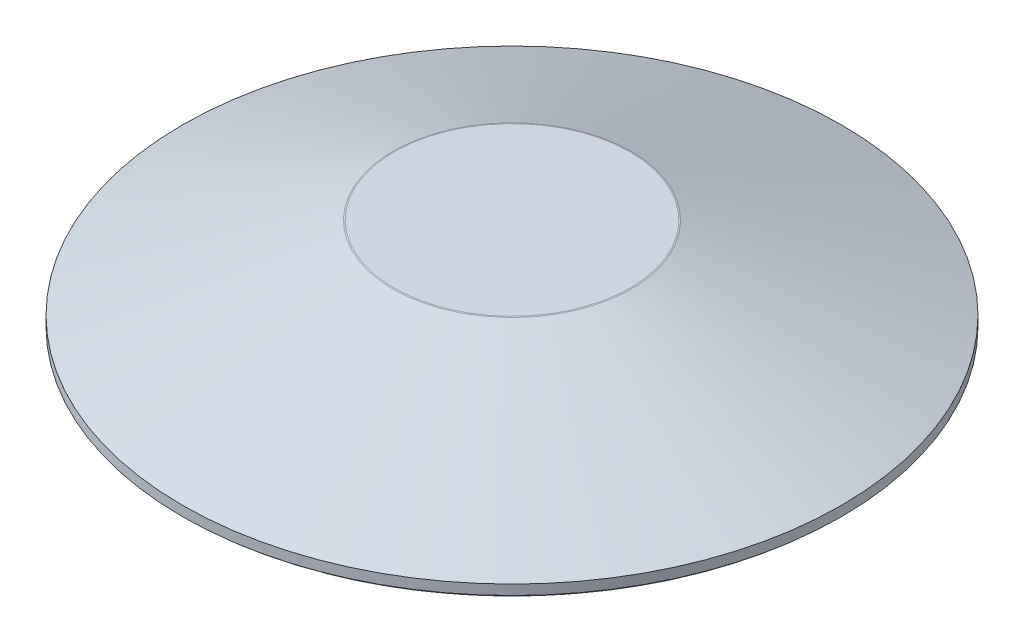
ISO-10303-21;
HEADER;
FILE_DESCRIPTION(('STEP AP214'),'2;1');
FILE_NAME('part.step','',(''),(''),'','','');
FILE_SCHEMA(('AUTOMOTIVE_DESIGN { 1 0 10303 214 1 1 1 1 }'));
ENDSEC;
DATA;
#1=APPLICATION_CONTEXT('core data for automotive mechanical design processes');
#2=APPLICATION_PROTOCOL_DEFINITION('international standard','automotive_design',2000,#1);
#3=PRODUCT_CONTEXT('',#1,'mechanical');
#4=PRODUCT('Part','Part','',(#3));
#5=PRODUCT_RELATED_PRODUCT_CATEGORY('part','',(#4));
#6=PRODUCT_DEFINITION_FORMATION('','',#4);
#7=PRODUCT_DEFINITION_CONTEXT('part definition',#1,'design');
#8=PRODUCT_DEFINITION('design','',#6,#7);
#9=PRODUCT_DEFINITION_SHAPE('','',#8);
#10=(LENGTH_UNIT() NAMED_UNIT(*) SI_UNIT(.MILLI.,.METRE.));
#11=(NAMED_UNIT(*) PLANE_ANGLE_UNIT() SI_UNIT($,.RADIAN.));
#12=(NAMED_UNIT(*) SI_UNIT($,.STERADIAN.) SOLID_ANGLE_UNIT());
#13=UNCERTAINTY_MEASURE_WITH_UNIT(LENGTH_MEASURE(1.E-05),#10,'distance_accuracy_value','');
#14=(GEOMETRIC_REPRESENTATION_CONTEXT(3) GLOBAL_UNCERTAINTY_ASSIGNED_CONTEXT((#13)) GLOBAL_UNIT_ASSIGNED_CONTEXT((#10,
#11,#12)) REPRESENTATION_CONTEXT('',''));
#15=CARTESIAN_POINT('',(0.,0.,0.));
#16=DIRECTION('',(0.,0.,1.));
#17=DIRECTION('',(1.,0.,0.));
#18=AXIS2_PLACEMENT_3D('',#15,#16,#17);
#19=CARTESIAN_POINT('',(0.,0.762500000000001,0.));
#20=DIRECTION('',(0.,-1.,0.));
#21=DIRECTION('',(0.,0.,-1.));
#22=AXIS2_PLACEMENT_3D('',#19,#20,#21);
#23=TOROIDAL_SURFACE('',#22,0.76215277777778,0.53784722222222);
#24=CARTESIAN_POINT('',(0.,1.18566154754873,0.));
#25=DIRECTION('',(0.,-1.,0.));
#26=DIRECTION('',(0.,0.,-1.));
#27=AXIS2_PLACEMENT_3D('',#24,#25,#26);
#28=CIRCLE('',#27,1.09413762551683);
#29=CARTESIAN_POINT('',(0.,1.18566154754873,-1.09413762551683));
#30=VERTEX_POINT('',#29);
#31=EDGE_CURVE('E10',#30,#30,#28,.T.);
#32=ORIENTED_EDGE('',*,*,#31,.T.);
#33=EDGE_LOOP('',(#32));
#34=FACE_BOUND('',#33,.T.);
#35=CARTESIAN_POINT('',(0.,0.327254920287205,0.));
#36=DIRECTION('',(0.,1.,0.));
#37=DIRECTION('',(0.,0.,1.));
#38=AXIS2_PLACEMENT_3D('',#35,#36,#37);
#39=CIRCLE('',#38,1.0781296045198);
#40=CARTESIAN_POINT('',(0.,0.327254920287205,1.0781296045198));
#41=VERTEX_POINT('',#40);
#42=EDGE_CURVE('E44',#41,#41,#39,.T.);
#43=ORIENTED_EDGE('',*,*,#42,.T.);
#44=EDGE_LOOP('',(#43));
#45=FACE_BOUND('',#44,.T.);
#46=ADVANCED_FACE('F37',(#34,#45),#23,.T.);
#47=CARTESIAN_POINT('',(0.,0.,0.));
#48=DIRECTION('',(0.,-1.,0.));
#49=DIRECTION('',(0.,0.,-1.));
#50=AXIS2_PLACEMENT_3D('',#47,#48,#49);
#51=CYLINDRICAL_SURFACE('',#50,1.075);
#52=CARTESIAN_POINT('',(0.,2.35,0.));
#53=DIRECTION('',(0.,1.,0.));
#54=DIRECTION('',(0.,0.,1.));
#55=AXIS2_PLACEMENT_3D('',#52,#53,#54);
#56=CIRCLE('',#55,1.075);
#57=CARTESIAN_POINT('',(0.,2.35,1.075));
#58=VERTEX_POINT('',#57);
#59=EDGE_CURVE('E60',#58,#58,#56,.F.);
#60=ORIENTED_EDGE('',*,*,#59,.T.);
#61=EDGE_LOOP('',(#60));
#62=FACE_BOUND('',#61,.T.);
#63=CARTESIAN_POINT('',(0.,1.225,0.));
#64=DIRECTION('',(0.,-1.,0.));
#65=DIRECTION('',(0.,0.,-1.));
#66=AXIS2_PLACEMENT_3D('',#63,#64,#65);
#67=CIRCLE('',#66,1.075);
#68=CARTESIAN_POINT('',(0.,1.225,-1.075));
#69=VERTEX_POINT('',#68);
#70=EDGE_CURVE('E63',#69,#69,#67,.F.);
#71=ORIENTED_EDGE('',*,*,#70,.T.);
#72=EDGE_LOOP('',(#71));
#73=FACE_BOUND('',#72,.T.);
#74=ADVANCED_FACE('F118',(#62,#73),#51,.T.);
#75=CARTESIAN_POINT('',(0.,2.4,0.));
#76=DIRECTION('',(0.,1.,0.));
#77=DIRECTION('',(0.,0.,1.));
#78=AXIS2_PLACEMENT_3D('',#75,#76,#77);
#79=PLANE('',#78);
#80=CARTESIAN_POINT('',(0.,2.4,0.));
#81=DIRECTION('',(0.,1.,0.));
#82=DIRECTION('',(0.,0.,1.));
#83=AXIS2_PLACEMENT_3D('',#80,#81,#82);
#84=CIRCLE('',#83,1.85);
#85=CARTESIAN_POINT('',(0.,2.4,1.85));
#86=VERTEX_POINT('',#85);
#87=EDGE_CURVE('E66',#86,#86,#84,.F.);
#88=ORIENTED_EDGE('',*,*,#87,.T.);
#89=EDGE_LOOP('',(#88));
#90=FACE_BOUND('',#89,.T.);
#91=CARTESIAN_POINT('',(0.,2.4,0.));
#92=DIRECTION('',(0.,1.,0.));
#93=DIRECTION('',(0.,0.,1.));
#94=AXIS2_PLACEMENT_3D('',#91,#92,#93);
#95=CIRCLE('',#94,1.125);
#96=CARTESIAN_POINT('',(0.,2.4,1.125));
#97=VERTEX_POINT('',#96);
#98=EDGE_CURVE('E69',#97,#97,#95,.T.);
#99=ORIENTED_EDGE('',*,*,#98,.T.);
#100=EDGE_LOOP('',(#99));
#101=FACE_BOUND('',#100,.T.);
#102=ADVANCED_FACE('F123',(#90,#101),#79,.F.);
#103=CARTESIAN_POINT('',(0.,0.,0.));
#104=DIRECTION('',(0.,-1.,0.));
#105=DIRECTION('',(0.,0.,-1.));
#106=AXIS2_PLACEMENT_3D('',#103,#104,#105);
#107=CYLINDRICAL_SURFACE('',#106,1.9);
#108=CARTESIAN_POINT('',(0.,2.98596117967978,0.));
#109=DIRECTION('',(0.,-1.,0.));
#110=DIRECTION('',(0.,0.,-1.));
#111=AXIS2_PLACEMENT_3D('',#108,#109,#110);
#112=CIRCLE('',#111,1.9);
#113=CARTESIAN_POINT('',(0.,2.98596117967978,-1.9));
#114=VERTEX_POINT('',#113);
#115=EDGE_CURVE('E75',#114,#114,#112,.T.);
#116=ORIENTED_EDGE('',*,*,#115,.T.);
#117=EDGE_LOOP('',(#116));
#118=FACE_BOUND('',#117,.T.);
#119=CARTESIAN_POINT('',(0.,2.45,0.));
#120=DIRECTION('',(0.,1.,0.));
#121=DIRECTION('',(0.,0.,1.));
#122=AXIS2_PLACEMENT_3D('',#119,#120,#121);
#123=CIRCLE('',#122,1.9);
#124=CARTESIAN_POINT('',(0.,2.45,1.9));
#125=VERTEX_POINT('',#124);
#126=EDGE_CURVE('E78',#125,#125,#123,.T.);
#127=ORIENTED_EDGE('',*,*,#126,.T.);
#128=EDGE_LOOP('',(#127));
#129=FACE_BOUND('',#128,.T.);
#130=ADVANCED_FACE('F260',(#118,#129),#107,.T.);
#131=CARTESIAN_POINT('',(0.,3.05,0.));
#132=DIRECTION('',(0.,-1.,0.));
#133=DIRECTION('',(0.,0.,-1.));
#134=AXIS2_PLACEMENT_3D('',#131,#132,#133);
#135=CONICAL_SURFACE('',#134,1.9,1.32581766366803);
#136=CARTESIAN_POINT('',(0.,3.03446830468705,0.));
#137=DIRECTION('',(0.,-1.,0.));
#138=DIRECTION('',(0.,0.,-1.));
#139=AXIS2_PLACEMENT_3D('',#136,#137,#138);
#140=CIRCLE('',#139,1.96212678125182);
#141=CARTESIAN_POINT('',(0.,3.03446830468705,-1.96212678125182));
#142=VERTEX_POINT('',#141);
#143=EDGE_CURVE('E72',#142,#142,#140,.F.);
#144=ORIENTED_EDGE('',*,*,#143,.T.);
#145=EDGE_LOOP('',(#144));
#146=FACE_BOUND('',#145,.T.);
#147=CARTESIAN_POINT('',(0.,2.4,0.));
#148=DIRECTION('',(0.,-1.,0.));
#149=DIRECTION('',(0.,0.,-1.));
#150=AXIS2_PLACEMENT_3D('',#147,#148,#149);
#151=CIRCLE('',#150,4.5);
#152=CARTESIAN_POINT('',(0.,2.4,-4.5));
#153=VERTEX_POINT('',#152);
#154=EDGE_CURVE('E87',#153,#153,#151,.T.);
#155=ORIENTED_EDGE('',*,*,#154,.T.);
#156=EDGE_LOOP('',(#155));
#157=FACE_BOUND('',#156,.T.);
#158=ADVANCED_FACE('F251',(#146,#157),#135,.F.);
#159=CARTESIAN_POINT('',(0.,2.64765625,0.));
#160=DIRECTION('',(0.,-1.,0.));
#161=DIRECTION('',(0.,0.,-1.));
#162=AXIS2_PLACEMENT_3D('',#159,#160,#161);
#163=TOROIDAL_SURFACE('',#162,4.75,0.351900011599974);
#164=CARTESIAN_POINT('',(0.,2.4,0.));
#165=DIRECTION('',(0.,-1.,0.));
#166=DIRECTION('',(0.,0.,-1.));
#167=AXIS2_PLACEMENT_3D('',#164,#165,#166);
#168=CIRCLE('',#167,5.);
#169=CARTESIAN_POINT('',(0.,2.4,-5.));
#170=VERTEX_POINT('',#169);
#171=EDGE_CURVE('E90',#170,#170,#168,.T.);
#172=ORIENTED_EDGE('',*,*,#171,.T.);
#173=EDGE_LOOP('',(#172));
#174=FACE_BOUND('',#173,.T.);
#175=ORIENTED_EDGE('',*,*,#154,.F.);
#176=EDGE_LOOP('',(#175));
#177=FACE_BOUND('',#176,.T.);
#178=ADVANCED_FACE('F241',(#174,#177),#163,.T.);
#179=CARTESIAN_POINT('',(0.,0.,0.));
#180=DIRECTION('',(0.,-1.,0.));
#181=DIRECTION('',(0.,0.,-1.));
#182=AXIS2_PLACEMENT_3D('',#179,#180,#181);
#183=CYLINDRICAL_SURFACE('',#182,5.);
#184=ORIENTED_EDGE('',*,*,#171,.F.);
#185=EDGE_LOOP('',(#184));
#186=FACE_BOUND('',#185,.T.);
#187=CARTESIAN_POINT('',(0.,2.55,0.));
#188=DIRECTION('',(0.,-1.,0.));
#189=DIRECTION('',(0.,0.,-1.));
#190=AXIS2_PLACEMENT_3D('',#187,#188,#189);
#191=CIRCLE('',#190,5.);
#192=CARTESIAN_POINT('',(0.,2.55,-5.));
#193=VERTEX_POINT('',#192);
#194=EDGE_CURVE('E93',#193,#193,#191,.T.);
#195=ORIENTED_EDGE('',*,*,#194,.T.);
#196=EDGE_LOOP('',(#195));
#197=FACE_BOUND('',#196,.T.);
#198=ADVANCED_FACE('F231',(#186,#197),#183,.T.);
#199=CARTESIAN_POINT('',(0.,3.8,0.));
#200=DIRECTION('',(0.,-1.,0.));
#201=DIRECTION('',(0.,0.,-1.));
#202=AXIS2_PLACEMENT_3D('',#199,#200,#201);
#203=CONICAL_SURFACE('',#202,1.8,1.19839788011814);
#204=CARTESIAN_POINT('',(0.,3.79657286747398,0.));
#205=DIRECTION('',(0.,1.,0.));
#206=DIRECTION('',(0.,0.,1.));
#207=AXIS2_PLACEMENT_3D('',#204,#205,#206);
#208=CIRCLE('',#207,1.80877345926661);
#209=CARTESIAN_POINT('',(0.,3.79657286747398,1.80877345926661));
#210=VERTEX_POINT('',#209);
#211=EDGE_CURVE('E84',#210,#210,#208,.F.);
#212=ORIENTED_EDGE('',*,*,#211,.T.);
#213=EDGE_LOOP('',(#212));
#214=FACE_BOUND('',#213,.T.);
#215=ORIENTED_EDGE('',*,*,#194,.F.);
#216=EDGE_LOOP('',(#215));
#217=FACE_BOUND('',#216,.T.);
#218=ADVANCED_FACE('F221',(#214,#217),#203,.T.);
#219=CARTESIAN_POINT('',(0.,3.8,0.));
#220=DIRECTION('',(0.,-1.,0.));
#221=DIRECTION('',(0.,0.,-1.));
#222=AXIS2_PLACEMENT_3D('',#219,#220,#221);
#223=PLANE('',#222);
#224=CARTESIAN_POINT('',(0.,3.8,0.));
#225=DIRECTION('',(0.,-1.,0.));
#226=DIRECTION('',(0.,0.,-1.));
#227=AXIS2_PLACEMENT_3D('',#224,#225,#226);
#228=CIRCLE('',#227,1.79058093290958);
#229=CARTESIAN_POINT('',(0.,3.8,-1.79058093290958));
#230=VERTEX_POINT('',#229);
#231=EDGE_CURVE('E81',#230,#230,#228,.F.);
#232=ORIENTED_EDGE('',*,*,#231,.T.);
#233=EDGE_LOOP('',(#232));
#234=FACE_BOUND('',#233,.T.);
#235=ADVANCED_FACE('F115',(#234),#223,.F.);
#236=CARTESIAN_POINT('',(0.,0.,0.));
#237=DIRECTION('',(0.,1.,0.));
#238=DIRECTION('',(0.,0.,1.));
#239=AXIS2_PLACEMENT_3D('',#236,#237,#238);
#240=PLANE('',#239);
#241=CARTESIAN_POINT('',(0.,0.,0.));
#242=DIRECTION('',(0.,-1.,0.));
#243=DIRECTION('',(0.,0.,-1.));
#244=AXIS2_PLACEMENT_3D('',#241,#242,#243);
#245=CIRCLE('',#244,0.9);
#246=CARTESIAN_POINT('',(0.,0.,-0.9));
#247=VERTEX_POINT('',#246);
#248=EDGE_CURVE('E96',#247,#247,#245,.T.);
#249=ORIENTED_EDGE('',*,*,#248,.T.);
#250=EDGE_LOOP('',(#249));
#251=FACE_BOUND('',#250,.T.);
#252=ADVANCED_FACE('F100',(#251),#240,.F.);
#253=CARTESIAN_POINT('',(0.,0.,0.));
#254=DIRECTION('',(0.,-1.,0.));
#255=DIRECTION('',(0.,0.,-1.));
#256=AXIS2_PLACEMENT_3D('',#253,#254,#255);
#257=CYLINDRICAL_SURFACE('',#256,0.9);
#258=CARTESIAN_POINT('',(0.,0.129289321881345,0.));
#259=DIRECTION('',(0.,-1.,0.));
#260=DIRECTION('',(0.,0.,-1.));
#261=AXIS2_PLACEMENT_3D('',#258,#259,#260);
#262=CIRCLE('',#261,0.9);
#263=CARTESIAN_POINT('',(0.,0.129289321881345,-0.9));
#264=VERTEX_POINT('',#263);
#265=EDGE_CURVE('E57',#264,#264,#262,.T.);
#266=ORIENTED_EDGE('',*,*,#265,.T.);
#267=EDGE_LOOP('',(#266));
#268=FACE_BOUND('',#267,.T.);
#269=ORIENTED_EDGE('',*,*,#248,.F.);
#270=EDGE_LOOP('',(#269));
#271=FACE_BOUND('',#270,.T.);
#272=ADVANCED_FACE('F102',(#268,#271),#257,.T.);
#273=CARTESIAN_POINT('',(0.,0.15,0.));
#274=DIRECTION('',(0.,1.,0.));
#275=DIRECTION('',(0.,0.,1.));
#276=AXIS2_PLACEMENT_3D('',#273,#274,#275);
#277=CONICAL_SURFACE('',#276,0.9,0.785398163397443);
#278=CARTESIAN_POINT('',(0.,0.164644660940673,0.));
#279=DIRECTION('',(0.,-1.,0.));
#280=DIRECTION('',(0.,0.,-1.));
#281=AXIS2_PLACEMENT_3D('',#278,#279,#280);
#282=CIRCLE('',#281,0.914644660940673);
#283=CARTESIAN_POINT('',(0.,0.164644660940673,-0.914644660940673));
#284=VERTEX_POINT('',#283);
#285=EDGE_CURVE('E48',#284,#284,#282,.F.);
#286=ORIENTED_EDGE('',*,*,#285,.T.);
#287=EDGE_LOOP('',(#286));
#288=FACE_BOUND('',#287,.T.);
#289=CARTESIAN_POINT('',(0.,0.322148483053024,0.));
#290=DIRECTION('',(0.,-1.,0.));
#291=DIRECTION('',(0.,0.,-1.));
#292=AXIS2_PLACEMENT_3D('',#289,#290,#291);
#293=CIRCLE('',#292,1.07214848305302);
#294=CARTESIAN_POINT('',(0.,0.322148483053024,-1.07214848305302));
#295=VERTEX_POINT('',#294);
#296=EDGE_CURVE('E52',#295,#295,#293,.T.);
#297=ORIENTED_EDGE('',*,*,#296,.T.);
#298=EDGE_LOOP('',(#297));
#299=FACE_BOUND('',#298,.T.);
#300=ADVANCED_FACE('F104',(#288,#299),#277,.T.);
#301=CARTESIAN_POINT('',(0.,3.75,0.));
#302=DIRECTION('',(0.,-1.,0.));
#303=DIRECTION('',(0.,0.,-1.));
#304=AXIS2_PLACEMENT_3D('',#301,#302,#303);
#305=TOROIDAL_SURFACE('',#304,1.79058093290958,0.05);
#306=ORIENTED_EDGE('',*,*,#231,.F.);
#307=EDGE_LOOP('',(#306));
#308=FACE_BOUND('',#307,.T.);
#309=ORIENTED_EDGE('',*,*,#211,.F.);
#310=EDGE_LOOP('',(#309));
#311=FACE_BOUND('',#310,.T.);
#312=ADVANCED_FACE('F111',(#308,#311),#305,.T.);
#313=CARTESIAN_POINT('',(0.,2.98596117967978,0.));
#314=DIRECTION('',(0.,-1.,0.));
#315=DIRECTION('',(0.,0.,-1.));
#316=AXIS2_PLACEMENT_3D('',#313,#314,#315);
#317=TOROIDAL_SURFACE('',#316,1.95,0.05);
#318=ORIENTED_EDGE('',*,*,#143,.F.);
#319=EDGE_LOOP('',(#318));
#320=FACE_BOUND('',#319,.T.);
#321=ORIENTED_EDGE('',*,*,#115,.F.);
#322=EDGE_LOOP('',(#321));
#323=FACE_BOUND('',#322,.T.);
#324=ADVANCED_FACE('F130',(#320,#323),#317,.F.);
#325=CARTESIAN_POINT('',(0.,2.45,0.));
#326=DIRECTION('',(0.,1.,0.));
#327=DIRECTION('',(0.,0.,1.));
#328=AXIS2_PLACEMENT_3D('',#325,#326,#327);
#329=TOROIDAL_SURFACE('',#328,1.85,0.05);
#330=ORIENTED_EDGE('',*,*,#126,.F.);
#331=EDGE_LOOP('',(#330));
#332=FACE_BOUND('',#331,.T.);
#333=ORIENTED_EDGE('',*,*,#87,.F.);
#334=EDGE_LOOP('',(#333));
#335=FACE_BOUND('',#334,.T.);
#336=ADVANCED_FACE('F134',(#332,#335),#329,.T.);
#337=CARTESIAN_POINT('',(0.,2.35,0.));
#338=DIRECTION('',(0.,1.,0.));
#339=DIRECTION('',(0.,0.,1.));
#340=AXIS2_PLACEMENT_3D('',#337,#338,#339);
#341=TOROIDAL_SURFACE('',#340,1.125,0.05);
#342=ORIENTED_EDGE('',*,*,#98,.F.);
#343=EDGE_LOOP('',(#342));
#344=FACE_BOUND('',#343,.T.);
#345=ORIENTED_EDGE('',*,*,#59,.F.);
#346=EDGE_LOOP('',(#345));
#347=FACE_BOUND('',#346,.T.);
#348=ADVANCED_FACE('F138',(#344,#347),#341,.F.);
#349=CARTESIAN_POINT('',(0.,0.129289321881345,0.));
#350=DIRECTION('',(0.,-1.,0.));
#351=DIRECTION('',(0.,0.,-1.));
#352=AXIS2_PLACEMENT_3D('',#349,#350,#351);
#353=TOROIDAL_SURFACE('',#352,0.95,0.05);
#354=ORIENTED_EDGE('',*,*,#285,.F.);
#355=EDGE_LOOP('',(#354));
#356=FACE_BOUND('',#355,.T.);
#357=ORIENTED_EDGE('',*,*,#265,.F.);
#358=EDGE_LOOP('',(#357));
#359=FACE_BOUND('',#358,.T.);
#360=ADVANCED_FACE('F142',(#356,#359),#353,.F.);
#361=CARTESIAN_POINT('',(0.,1.225,0.));
#362=DIRECTION('',(0.,-1.,0.));
#363=DIRECTION('',(0.,0.,-1.));
#364=AXIS2_PLACEMENT_3D('',#361,#362,#363);
#365=TOROIDAL_SURFACE('',#364,1.125,0.05);
#366=ORIENTED_EDGE('',*,*,#70,.F.);
#367=EDGE_LOOP('',(#366));
#368=FACE_BOUND('',#367,.T.);
#369=ORIENTED_EDGE('',*,*,#31,.F.);
#370=EDGE_LOOP('',(#369));
#371=FACE_BOUND('',#370,.T.);
#372=ADVANCED_FACE('F145',(#368,#371),#365,.F.);
#373=CARTESIAN_POINT('',(0.,0.286793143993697,0.));
#374=DIRECTION('',(0.,-1.,0.));
#375=DIRECTION('',(0.,0.,-1.));
#376=AXIS2_PLACEMENT_3D('',#373,#374,#375);
#377=TOROIDAL_SURFACE('',#376,1.10750382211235,0.05);
#378=ORIENTED_EDGE('',*,*,#42,.F.);
#379=EDGE_LOOP('',(#378));
#380=FACE_BOUND('',#379,.T.);
#381=ORIENTED_EDGE('',*,*,#296,.F.);
#382=EDGE_LOOP('',(#381));
#383=FACE_BOUND('',#382,.T.);
#384=ADVANCED_FACE('F39',(#380,#383),#377,.F.);
#385=CLOSED_SHELL('',(#46,#74,#102,#130,#158,#178,#198,#218,#235,#252,#272,#300,#312,#324,#336,
#348,#360,#372,#384));
#386=MANIFOLD_SOLID_BREP('B2',#385);
#387=ADVANCED_BREP_SHAPE_REPRESENTATION('',(#18,#386),#14);
#388=SHAPE_DEFINITION_REPRESENTATION(#9,#387);
ENDSEC;
END-ISO-10303-21;
